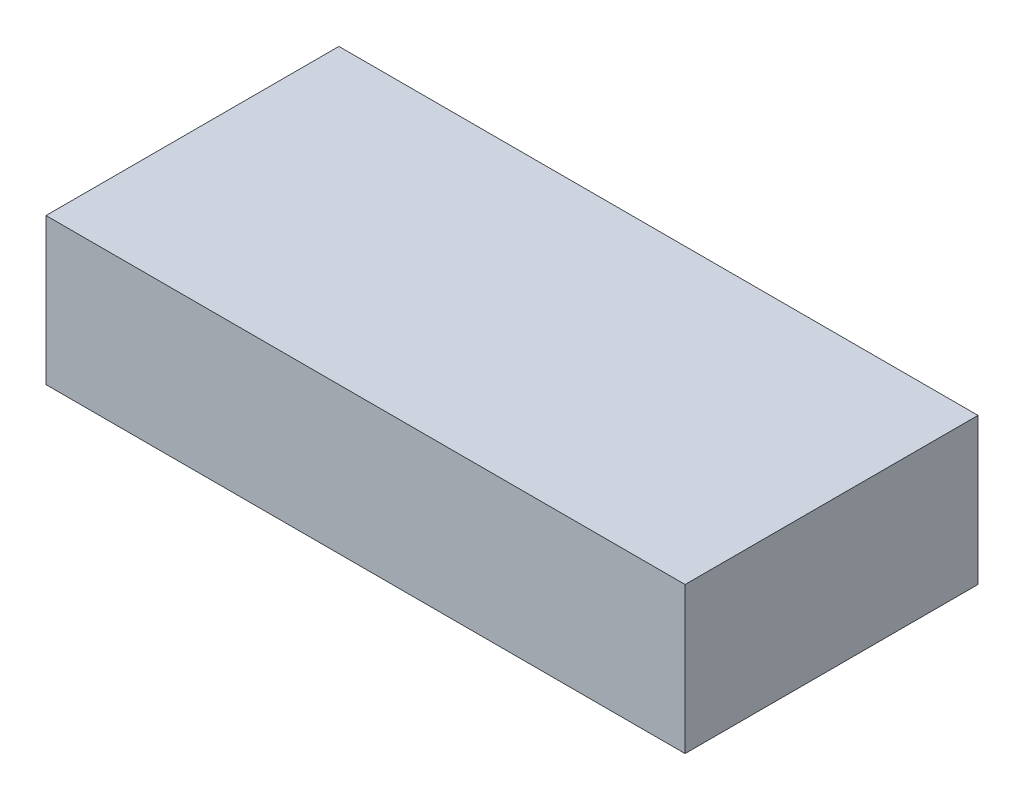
ISO-10303-21;
HEADER;
FILE_DESCRIPTION(('STEP AP214'),'2;1');
FILE_NAME('part.step','',(''),(''),'','','');
FILE_SCHEMA(('AUTOMOTIVE_DESIGN { 1 0 10303 214 1 1 1 1 }'));
ENDSEC;
DATA;
#1=APPLICATION_CONTEXT('core data for automotive mechanical design processes');
#2=APPLICATION_PROTOCOL_DEFINITION('international standard','automotive_design',2000,#1);
#3=PRODUCT_CONTEXT('',#1,'mechanical');
#4=PRODUCT('Part','Part','',(#3));
#5=PRODUCT_RELATED_PRODUCT_CATEGORY('part','',(#4));
#6=PRODUCT_DEFINITION_FORMATION('','',#4);
#7=PRODUCT_DEFINITION_CONTEXT('part definition',#1,'design');
#8=PRODUCT_DEFINITION('design','',#6,#7);
#9=PRODUCT_DEFINITION_SHAPE('','',#8);
#10=(LENGTH_UNIT() NAMED_UNIT(*) SI_UNIT(.MILLI.,.METRE.));
#11=(NAMED_UNIT(*) PLANE_ANGLE_UNIT() SI_UNIT($,.RADIAN.));
#12=(NAMED_UNIT(*) SI_UNIT($,.STERADIAN.) SOLID_ANGLE_UNIT());
#13=UNCERTAINTY_MEASURE_WITH_UNIT(LENGTH_MEASURE(1.E-05),#10,'distance_accuracy_value','');
#14=(GEOMETRIC_REPRESENTATION_CONTEXT(3) GLOBAL_UNCERTAINTY_ASSIGNED_CONTEXT((#13)) GLOBAL_UNIT_ASSIGNED_CONTEXT((#10,
#11,#12)) REPRESENTATION_CONTEXT('',''));
#15=CARTESIAN_POINT('',(0.,0.,0.));
#16=DIRECTION('',(0.,0.,1.));
#17=DIRECTION('',(1.,0.,0.));
#18=AXIS2_PLACEMENT_3D('',#15,#16,#17);
#19=CARTESIAN_POINT('',(0.,0.,110.));
#20=DIRECTION('',(1.,0.,0.));
#21=DIRECTION('',(0.,0.,-1.));
#22=AXIS2_PLACEMENT_3D('',#19,#20,#21);
#23=PLANE('',#22);
#24=DIRECTION('',(0.,-1.,0.));
#25=VECTOR('',#24,1.);
#26=CARTESIAN_POINT('',(0.,0.,0.));
#27=LINE('',#26,#25);
#28=CARTESIAN_POINT('',(0.,55.,0.));
#29=VERTEX_POINT('',#28);
#30=CARTESIAN_POINT('',(0.,0.,0.));
#31=VERTEX_POINT('',#30);
#32=EDGE_CURVE('E96',#29,#31,#27,.T.);
#33=ORIENTED_EDGE('',*,*,#32,.T.);
#34=DIRECTION('',(0.,0.,-1.));
#35=VECTOR('',#34,1.);
#36=CARTESIAN_POINT('',(0.,0.,110.));
#37=LINE('',#36,#35);
#38=CARTESIAN_POINT('',(0.,0.,110.));
#39=VERTEX_POINT('',#38);
#40=EDGE_CURVE('E11',#39,#31,#37,.T.);
#41=ORIENTED_EDGE('',*,*,#40,.F.);
#42=DIRECTION('',(0.,-1.,0.));
#43=VECTOR('',#42,1.);
#44=CARTESIAN_POINT('',(0.,0.,110.));
#45=LINE('',#44,#43);
#46=CARTESIAN_POINT('',(0.,55.,110.));
#47=VERTEX_POINT('',#46);
#48=EDGE_CURVE('E84',#47,#39,#45,.T.);
#49=ORIENTED_EDGE('',*,*,#48,.F.);
#50=DIRECTION('',(0.,0.,-1.));
#51=VECTOR('',#50,1.);
#52=CARTESIAN_POINT('',(0.,55.,110.));
#53=LINE('',#52,#51);
#54=EDGE_CURVE('E92',#47,#29,#53,.T.);
#55=ORIENTED_EDGE('',*,*,#54,.T.);
#56=EDGE_LOOP('',(#33,#41,#49,#55));
#57=FACE_BOUND('',#56,.T.);
#58=ADVANCED_FACE('F33',(#57),#23,.F.);
#59=CARTESIAN_POINT('',(0.,0.,110.));
#60=DIRECTION('',(0.,1.,0.));
#61=DIRECTION('',(0.,0.,1.));
#62=AXIS2_PLACEMENT_3D('',#59,#60,#61);
#63=PLANE('',#62);
#64=DIRECTION('',(1.,0.,0.));
#65=VECTOR('',#64,1.);
#66=CARTESIAN_POINT('',(0.,0.,0.));
#67=LINE('',#66,#65);
#68=CARTESIAN_POINT('',(240.,0.,0.));
#69=VERTEX_POINT('',#68);
#70=EDGE_CURVE('E88',#31,#69,#67,.T.);
#71=ORIENTED_EDGE('',*,*,#70,.T.);
#72=DIRECTION('',(0.,0.,-1.));
#73=VECTOR('',#72,1.);
#74=CARTESIAN_POINT('',(240.,0.,110.));
#75=LINE('',#74,#73);
#76=CARTESIAN_POINT('',(240.,0.,110.));
#77=VERTEX_POINT('',#76);
#78=EDGE_CURVE('E41',#77,#69,#75,.T.);
#79=ORIENTED_EDGE('',*,*,#78,.F.);
#80=DIRECTION('',(1.,0.,0.));
#81=VECTOR('',#80,1.);
#82=CARTESIAN_POINT('',(0.,0.,110.));
#83=LINE('',#82,#81);
#84=EDGE_CURVE('E79',#39,#77,#83,.T.);
#85=ORIENTED_EDGE('',*,*,#84,.F.);
#86=ORIENTED_EDGE('',*,*,#40,.T.);
#87=EDGE_LOOP('',(#71,#79,#85,#86));
#88=FACE_BOUND('',#87,.T.);
#89=ADVANCED_FACE('F87',(#88),#63,.F.);
#90=CARTESIAN_POINT('',(240.,0.,110.));
#91=DIRECTION('',(-1.,0.,0.));
#92=DIRECTION('',(0.,0.,1.));
#93=AXIS2_PLACEMENT_3D('',#90,#91,#92);
#94=PLANE('',#93);
#95=DIRECTION('',(0.,1.,0.));
#96=VECTOR('',#95,1.);
#97=CARTESIAN_POINT('',(240.,0.,0.));
#98=LINE('',#97,#96);
#99=CARTESIAN_POINT('',(240.,55.,0.));
#100=VERTEX_POINT('',#99);
#101=EDGE_CURVE('E66',#69,#100,#98,.T.);
#102=ORIENTED_EDGE('',*,*,#101,.T.);
#103=DIRECTION('',(0.,0.,-1.));
#104=VECTOR('',#103,1.);
#105=CARTESIAN_POINT('',(240.,55.,110.));
#106=LINE('',#105,#104);
#107=CARTESIAN_POINT('',(240.,55.,110.));
#108=VERTEX_POINT('',#107);
#109=EDGE_CURVE('E89',#108,#100,#106,.T.);
#110=ORIENTED_EDGE('',*,*,#109,.F.);
#111=DIRECTION('',(0.,1.,0.));
#112=VECTOR('',#111,1.);
#113=CARTESIAN_POINT('',(240.,0.,110.));
#114=LINE('',#113,#112);
#115=EDGE_CURVE('E82',#77,#108,#114,.T.);
#116=ORIENTED_EDGE('',*,*,#115,.F.);
#117=ORIENTED_EDGE('',*,*,#78,.T.);
#118=EDGE_LOOP('',(#102,#110,#116,#117));
#119=FACE_BOUND('',#118,.T.);
#120=ADVANCED_FACE('F90',(#119),#94,.F.);
#121=CARTESIAN_POINT('',(0.,55.,110.));
#122=DIRECTION('',(0.,-1.,0.));
#123=DIRECTION('',(0.,0.,-1.));
#124=AXIS2_PLACEMENT_3D('',#121,#122,#123);
#125=PLANE('',#124);
#126=DIRECTION('',(-1.,0.,0.));
#127=VECTOR('',#126,1.);
#128=CARTESIAN_POINT('',(0.,55.,0.));
#129=LINE('',#128,#127);
#130=EDGE_CURVE('E72',#100,#29,#129,.T.);
#131=ORIENTED_EDGE('',*,*,#130,.T.);
#132=ORIENTED_EDGE('',*,*,#54,.F.);
#133=DIRECTION('',(-1.,0.,0.));
#134=VECTOR('',#133,1.);
#135=CARTESIAN_POINT('',(0.,55.,110.));
#136=LINE('',#135,#134);
#137=EDGE_CURVE('E49',#108,#47,#136,.T.);
#138=ORIENTED_EDGE('',*,*,#137,.F.);
#139=ORIENTED_EDGE('',*,*,#109,.T.);
#140=EDGE_LOOP('',(#131,#132,#138,#139));
#141=FACE_BOUND('',#140,.T.);
#142=ADVANCED_FACE('F103',(#141),#125,.F.);
#143=CARTESIAN_POINT('',(0.,0.,110.));
#144=DIRECTION('',(0.,0.,-1.));
#145=DIRECTION('',(-1.,0.,0.));
#146=AXIS2_PLACEMENT_3D('',#143,#144,#145);
#147=PLANE('',#146);
#148=ORIENTED_EDGE('',*,*,#48,.T.);
#149=ORIENTED_EDGE('',*,*,#84,.T.);
#150=ORIENTED_EDGE('',*,*,#115,.T.);
#151=ORIENTED_EDGE('',*,*,#137,.T.);
#152=EDGE_LOOP('',(#148,#149,#150,#151));
#153=FACE_BOUND('',#152,.T.);
#154=ADVANCED_FACE('F80',(#153),#147,.F.);
#155=CARTESIAN_POINT('',(0.,0.,0.));
#156=DIRECTION('',(0.,0.,-1.));
#157=DIRECTION('',(-1.,0.,0.));
#158=AXIS2_PLACEMENT_3D('',#155,#156,#157);
#159=PLANE('',#158);
#160=ORIENTED_EDGE('',*,*,#32,.F.);
#161=ORIENTED_EDGE('',*,*,#130,.F.);
#162=ORIENTED_EDGE('',*,*,#101,.F.);
#163=ORIENTED_EDGE('',*,*,#70,.F.);
#164=EDGE_LOOP('',(#160,#161,#162,#163));
#165=FACE_BOUND('',#164,.T.);
#166=ADVANCED_FACE('F106',(#165),#159,.T.);
#167=CLOSED_SHELL('',(#58,#89,#120,#142,#154,#166));
#168=MANIFOLD_SOLID_BREP('B2',#167);
#169=ADVANCED_BREP_SHAPE_REPRESENTATION('',(#18,#168),#14);
#170=SHAPE_DEFINITION_REPRESENTATION(#9,#169);
ENDSEC;
END-ISO-10303-21;
